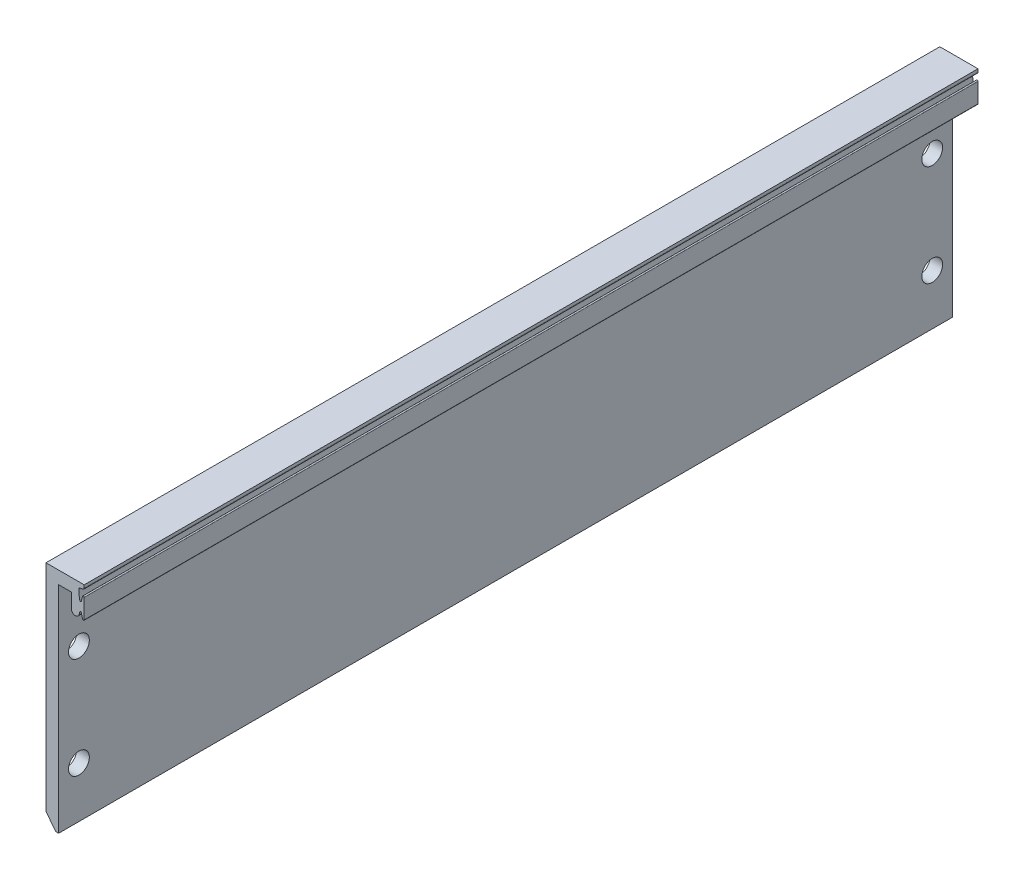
from build123d import *

# Parameters (mm, degrees)
EXTRUDE_1_DEPTH     = 88.225
SKETCH_2_R          = 2.05
CUT_EXTRUDE_1_DEPTH = 3108.063439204


with BuildPart() as part:
    # Sketch 1 → Extrude 1 (new, symmetric)
    with BuildSketch(Plane.XY):
        with BuildLine():
            Line((2261.939900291, -3061.761167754), (2262.488979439, -3061.672269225))
            ThreePointArc((2262.488979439, -3061.672269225), (2262.669488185, -3061.570568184), (2262.741032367, -3061.376125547))
            Line((2262.741032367, -3061.376125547), (2262.741032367, -3060.801460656))
            Line((2262.741032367, -3060.801460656), (2255.201032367, -3060.801460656))
            Line((2255.201032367, -3060.801460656), (2255.201032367, -3103.301460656))
            Line((2255.201032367, -3103.301460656), (2257.101032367, -3105.801460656))
            Line((2257.101032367, -3105.801460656), (2257.701032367, -3105.801460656))
            Line((2257.701032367, -3105.801460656), (2257.701032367, -3063.301460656))
            Line((2257.701032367, -3063.301460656), (2260.201032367, -3063.301460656))
            Line((2260.201032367, -3063.301460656), (2260.201032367, -3066.167750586))
            ThreePointArc((2260.201032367, -3066.167750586), (2260.881368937, -3066.944613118), (2261.741182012, -3066.372691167))
            Line((2261.741182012, -3066.372691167), (2261.886251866, -3065.83723558))
            ThreePointArc((2261.886251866, -3065.83723558), (2262.032698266, -3065.726469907), (2262.176648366, -3065.84046092))
            Line((2262.176648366, -3065.84046092), (2262.420781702, -3066.82796037))
            ThreePointArc((2262.420781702, -3066.82796037), (2262.598176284, -3066.950268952), (2262.741032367, -3066.788960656))
            Line((2262.741032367, -3066.788960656), (2262.741032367, -3062.963960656))
            ThreePointArc((2262.741032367, -3062.963960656), (2262.598176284, -3062.802652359), (2262.420781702, -3062.924960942))
            Line((2262.420781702, -3062.924960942), (2262.176648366, -3063.912460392))
            ThreePointArc((2262.176648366, -3063.912460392), (2262.021628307, -3064.026165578), (2261.882056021, -3063.893954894))
            ThreePointArc((2261.882056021, -3063.893954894), (2261.718086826, -3062.976641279), (2261.688089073, -3062.045271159))
            ThreePointArc((2261.688089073, -3062.045271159), (2261.763340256, -3061.85832259), (2261.939900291, -3061.761167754))
        make_face()
    extrude(amount=EXTRUDE_1_DEPTH, both=True)

    # Sketch 2 → Cut-Extrude 1 (cut, through all)
    with BuildSketch(Plane.ZY.offset(-2255.201032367)):
        with Locations(Location((-84.225, -3075.801460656, 0), (0, 0, 270))):
            Circle(SKETCH_2_R)
        with Locations(Location((-84.225, -3095.801460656, 0), (0, 0, 270))):
            Circle(SKETCH_2_R)
        with Locations(Location((84.225, -3095.801460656, 0), (0, 0, 270))):
            Circle(SKETCH_2_R)
        with Locations(Location((84.225, -3075.801460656, 0), (0, 0, 270))):
            Circle(SKETCH_2_R)
    extrude(amount=-CUT_EXTRUDE_1_DEPTH, mode=Mode.SUBTRACT)


solid = part.part
